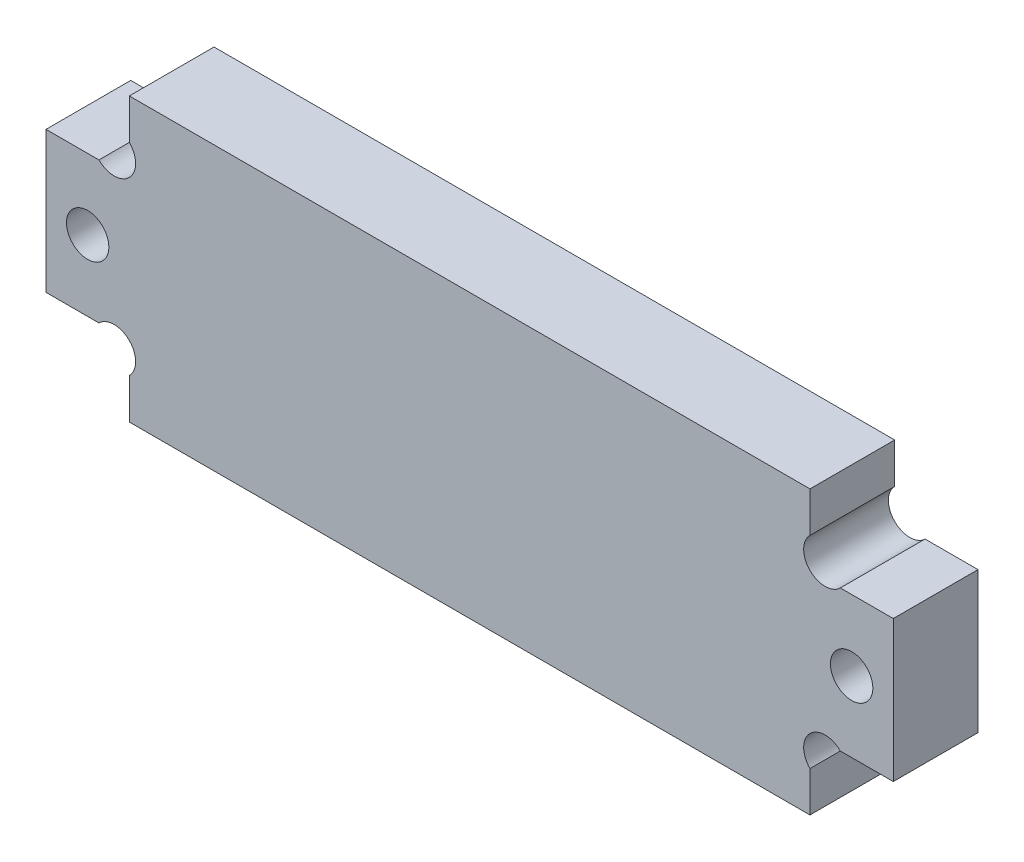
from build123d import *

# Parameters (mm, degrees)
ESQUISSE1_R      = 1.5
EXTRUSION1_DEPTH = 6


with BuildPart() as part:
    # Esquisse1 → Extrusion1 (new body)
    with BuildSketch(Plane.XY):
        with BuildLine():
            Line((0, 5), (3.750395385, 5))
            ThreePointArc((3.750395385, 5), (5.9, 5), (5.9, 2.850395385))
            Line((5.9, 2.850395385), (5.9, 0))
            Line((5.9, 0), (54.1, 0))
            Line((54.1, 0), (54.1, 2.850395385))
            ThreePointArc((54.1, 2.850395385), (54.1, 5), (56.249604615, 5))
            Line((56.249604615, 5), (60, 5))
            Line((60, 5), (60, 15))
            Line((60, 15), (56.249604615, 15))
            ThreePointArc((56.249604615, 15), (54.1, 15), (54.1, 17.149604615))
            Line((54.1, 17.149604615), (54.1, 20))
            Line((54.1, 20), (5.9, 20))
            Line((5.9, 20), (5.9, 17.149604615))
            ThreePointArc((5.9, 17.149604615), (5.9, 15), (3.750395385, 15))
            Line((3.750395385, 15), (0, 15))
            Line((0, 15), (0, 5))
        make_face()
        with Locations((2.95, 10)):
            Circle(ESQUISSE1_R, mode=Mode.SUBTRACT)
        with Locations(Location((57.05, 10, 0), (0, 0, 180))):
            Circle(ESQUISSE1_R, mode=Mode.SUBTRACT)
    extrude(amount=EXTRUSION1_DEPTH)


solid = part.part
